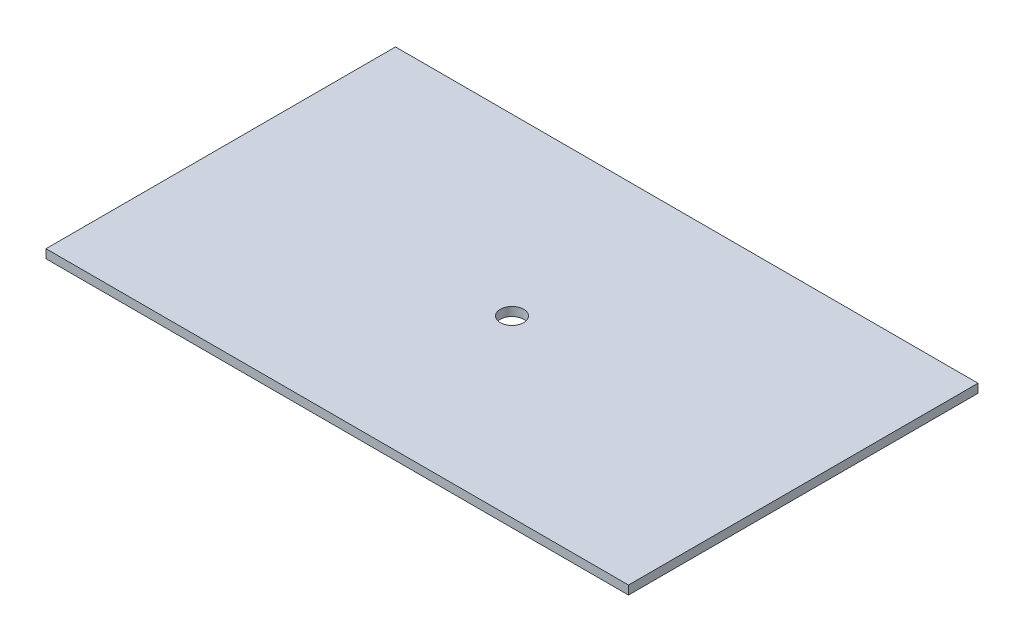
ISO-10303-21;
HEADER;
FILE_DESCRIPTION(('STEP AP214'),'2;1');
FILE_NAME('part.step','',(''),(''),'','','');
FILE_SCHEMA(('AUTOMOTIVE_DESIGN { 1 0 10303 214 1 1 1 1 }'));
ENDSEC;
DATA;
#1=APPLICATION_CONTEXT('core data for automotive mechanical design processes');
#2=APPLICATION_PROTOCOL_DEFINITION('international standard','automotive_design',2000,#1);
#3=PRODUCT_CONTEXT('',#1,'mechanical');
#4=PRODUCT('Part','Part','',(#3));
#5=PRODUCT_RELATED_PRODUCT_CATEGORY('part','',(#4));
#6=PRODUCT_DEFINITION_FORMATION('','',#4);
#7=PRODUCT_DEFINITION_CONTEXT('part definition',#1,'design');
#8=PRODUCT_DEFINITION('design','',#6,#7);
#9=PRODUCT_DEFINITION_SHAPE('','',#8);
#10=(LENGTH_UNIT() NAMED_UNIT(*) SI_UNIT(.MILLI.,.METRE.));
#11=(NAMED_UNIT(*) PLANE_ANGLE_UNIT() SI_UNIT($,.RADIAN.));
#12=(NAMED_UNIT(*) SI_UNIT($,.STERADIAN.) SOLID_ANGLE_UNIT());
#13=UNCERTAINTY_MEASURE_WITH_UNIT(LENGTH_MEASURE(1.E-05),#10,'distance_accuracy_value','');
#14=(GEOMETRIC_REPRESENTATION_CONTEXT(3) GLOBAL_UNCERTAINTY_ASSIGNED_CONTEXT((#13)) GLOBAL_UNIT_ASSIGNED_CONTEXT((#10,
#11,#12)) REPRESENTATION_CONTEXT('',''));
#15=CARTESIAN_POINT('',(0.,0.,0.));
#16=DIRECTION('',(0.,0.,1.));
#17=DIRECTION('',(1.,0.,0.));
#18=AXIS2_PLACEMENT_3D('',#15,#16,#17);
#19=CARTESIAN_POINT('',(-50.,1.5,-30.));
#20=DIRECTION('',(1.,0.,0.));
#21=DIRECTION('',(0.,0.,-1.));
#22=AXIS2_PLACEMENT_3D('',#19,#20,#21);
#23=PLANE('',#22);
#24=DIRECTION('',(0.,0.,1.));
#25=VECTOR('',#24,1.);
#26=CARTESIAN_POINT('',(-50.,0.,-30.));
#27=LINE('',#26,#25);
#28=CARTESIAN_POINT('',(-50.,0.,-30.));
#29=VERTEX_POINT('',#28);
#30=CARTESIAN_POINT('',(-50.,0.,30.));
#31=VERTEX_POINT('',#30);
#32=EDGE_CURVE('E88',#29,#31,#27,.T.);
#33=ORIENTED_EDGE('',*,*,#32,.T.);
#34=DIRECTION('',(0.,-1.,0.));
#35=VECTOR('',#34,1.);
#36=CARTESIAN_POINT('',(-50.,1.5,30.));
#37=LINE('',#36,#35);
#38=CARTESIAN_POINT('',(-50.,1.5,30.));
#39=VERTEX_POINT('',#38);
#40=EDGE_CURVE('E11',#39,#31,#37,.T.);
#41=ORIENTED_EDGE('',*,*,#40,.F.);
#42=DIRECTION('',(0.,0.,1.));
#43=VECTOR('',#42,1.);
#44=CARTESIAN_POINT('',(-50.,1.5,-30.));
#45=LINE('',#44,#43);
#46=CARTESIAN_POINT('',(-50.,1.5,-30.));
#47=VERTEX_POINT('',#46);
#48=EDGE_CURVE('E111',#47,#39,#45,.T.);
#49=ORIENTED_EDGE('',*,*,#48,.F.);
#50=DIRECTION('',(0.,-1.,0.));
#51=VECTOR('',#50,1.);
#52=CARTESIAN_POINT('',(-50.,1.5,-30.));
#53=LINE('',#52,#51);
#54=EDGE_CURVE('E100',#47,#29,#53,.T.);
#55=ORIENTED_EDGE('',*,*,#54,.T.);
#56=EDGE_LOOP('',(#33,#41,#49,#55));
#57=FACE_BOUND('',#56,.T.);
#58=ADVANCED_FACE('F44',(#57),#23,.F.);
#59=CARTESIAN_POINT('',(-50.,1.5,30.));
#60=DIRECTION('',(0.,0.,-1.));
#61=DIRECTION('',(-1.,0.,0.));
#62=AXIS2_PLACEMENT_3D('',#59,#60,#61);
#63=PLANE('',#62);
#64=DIRECTION('',(1.,0.,0.));
#65=VECTOR('',#64,1.);
#66=CARTESIAN_POINT('',(-50.,0.,30.));
#67=LINE('',#66,#65);
#68=CARTESIAN_POINT('',(50.,0.,30.));
#69=VERTEX_POINT('',#68);
#70=EDGE_CURVE('E84',#31,#69,#67,.T.);
#71=ORIENTED_EDGE('',*,*,#70,.T.);
#72=DIRECTION('',(0.,-1.,0.));
#73=VECTOR('',#72,1.);
#74=CARTESIAN_POINT('',(50.,1.5,30.));
#75=LINE('',#74,#73);
#76=CARTESIAN_POINT('',(50.,1.5,30.));
#77=VERTEX_POINT('',#76);
#78=EDGE_CURVE('E51',#77,#69,#75,.T.);
#79=ORIENTED_EDGE('',*,*,#78,.F.);
#80=DIRECTION('',(1.,0.,0.));
#81=VECTOR('',#80,1.);
#82=CARTESIAN_POINT('',(-50.,1.5,30.));
#83=LINE('',#82,#81);
#84=EDGE_CURVE('E96',#39,#77,#83,.T.);
#85=ORIENTED_EDGE('',*,*,#84,.F.);
#86=ORIENTED_EDGE('',*,*,#40,.T.);
#87=EDGE_LOOP('',(#71,#79,#85,#86));
#88=FACE_BOUND('',#87,.T.);
#89=ADVANCED_FACE('F95',(#88),#63,.F.);
#90=CARTESIAN_POINT('',(50.,1.5,-30.));
#91=DIRECTION('',(-1.,0.,0.));
#92=DIRECTION('',(0.,0.,1.));
#93=AXIS2_PLACEMENT_3D('',#90,#91,#92);
#94=PLANE('',#93);
#95=DIRECTION('',(0.,0.,-1.));
#96=VECTOR('',#95,1.);
#97=CARTESIAN_POINT('',(50.,0.,-30.));
#98=LINE('',#97,#96);
#99=CARTESIAN_POINT('',(50.,0.,-30.));
#100=VERTEX_POINT('',#99);
#101=EDGE_CURVE('E89',#69,#100,#98,.T.);
#102=ORIENTED_EDGE('',*,*,#101,.T.);
#103=DIRECTION('',(0.,-1.,0.));
#104=VECTOR('',#103,1.);
#105=CARTESIAN_POINT('',(50.,1.5,-30.));
#106=LINE('',#105,#104);
#107=CARTESIAN_POINT('',(50.,1.5,-30.));
#108=VERTEX_POINT('',#107);
#109=EDGE_CURVE('E117',#108,#100,#106,.T.);
#110=ORIENTED_EDGE('',*,*,#109,.F.);
#111=DIRECTION('',(0.,0.,-1.));
#112=VECTOR('',#111,1.);
#113=CARTESIAN_POINT('',(50.,1.5,-30.));
#114=LINE('',#113,#112);
#115=EDGE_CURVE('E63',#77,#108,#114,.T.);
#116=ORIENTED_EDGE('',*,*,#115,.F.);
#117=ORIENTED_EDGE('',*,*,#78,.T.);
#118=EDGE_LOOP('',(#102,#110,#116,#117));
#119=FACE_BOUND('',#118,.T.);
#120=ADVANCED_FACE('F120',(#119),#94,.F.);
#121=CARTESIAN_POINT('',(-50.,1.5,-30.));
#122=DIRECTION('',(0.,0.,1.));
#123=DIRECTION('',(1.,0.,0.));
#124=AXIS2_PLACEMENT_3D('',#121,#122,#123);
#125=PLANE('',#124);
#126=DIRECTION('',(-1.,0.,0.));
#127=VECTOR('',#126,1.);
#128=CARTESIAN_POINT('',(-50.,0.,-30.));
#129=LINE('',#128,#127);
#130=EDGE_CURVE('E109',#100,#29,#129,.T.);
#131=ORIENTED_EDGE('',*,*,#130,.T.);
#132=ORIENTED_EDGE('',*,*,#54,.F.);
#133=DIRECTION('',(-1.,0.,0.));
#134=VECTOR('',#133,1.);
#135=CARTESIAN_POINT('',(-50.,1.5,-30.));
#136=LINE('',#135,#134);
#137=EDGE_CURVE('E58',#108,#47,#136,.T.);
#138=ORIENTED_EDGE('',*,*,#137,.F.);
#139=ORIENTED_EDGE('',*,*,#109,.T.);
#140=EDGE_LOOP('',(#131,#132,#138,#139));
#141=FACE_BOUND('',#140,.T.);
#142=ADVANCED_FACE('F122',(#141),#125,.F.);
#143=CARTESIAN_POINT('',(-50.,1.5,30.));
#144=DIRECTION('',(0.,1.,0.));
#145=DIRECTION('',(0.,0.,1.));
#146=AXIS2_PLACEMENT_3D('',#143,#144,#145);
#147=PLANE('',#146);
#148=CARTESIAN_POINT('',(0.,1.5,0.));
#149=DIRECTION('',(0.,1.,0.));
#150=DIRECTION('',(0.,0.,1.));
#151=AXIS2_PLACEMENT_3D('',#148,#149,#150);
#152=CIRCLE('',#151,2.);
#153=CARTESIAN_POINT('',(0.,1.5,2.));
#154=VERTEX_POINT('',#153);
#155=EDGE_CURVE('E104',#154,#154,#152,.T.);
#156=ORIENTED_EDGE('',*,*,#155,.F.);
#157=EDGE_LOOP('',(#156));
#158=FACE_BOUND('',#157,.T.);
#159=ORIENTED_EDGE('',*,*,#48,.T.);
#160=ORIENTED_EDGE('',*,*,#84,.T.);
#161=ORIENTED_EDGE('',*,*,#115,.T.);
#162=ORIENTED_EDGE('',*,*,#137,.T.);
#163=EDGE_LOOP('',(#159,#160,#161,#162));
#164=FACE_BOUND('',#163,.T.);
#165=ADVANCED_FACE('F123',(#158,#164),#147,.T.);
#166=CARTESIAN_POINT('',(-50.,0.,30.));
#167=DIRECTION('',(0.,1.,0.));
#168=DIRECTION('',(0.,0.,1.));
#169=AXIS2_PLACEMENT_3D('',#166,#167,#168);
#170=PLANE('',#169);
#171=CARTESIAN_POINT('',(0.,0.,0.));
#172=DIRECTION('',(0.,1.,0.));
#173=DIRECTION('',(0.,0.,1.));
#174=AXIS2_PLACEMENT_3D('',#171,#172,#173);
#175=CIRCLE('',#174,2.);
#176=CARTESIAN_POINT('',(0.,0.,2.));
#177=VERTEX_POINT('',#176);
#178=EDGE_CURVE('E101',#177,#177,#175,.T.);
#179=ORIENTED_EDGE('',*,*,#178,.T.);
#180=EDGE_LOOP('',(#179));
#181=FACE_BOUND('',#180,.T.);
#182=ORIENTED_EDGE('',*,*,#32,.F.);
#183=ORIENTED_EDGE('',*,*,#130,.F.);
#184=ORIENTED_EDGE('',*,*,#101,.F.);
#185=ORIENTED_EDGE('',*,*,#70,.F.);
#186=EDGE_LOOP('',(#182,#183,#184,#185));
#187=FACE_BOUND('',#186,.T.);
#188=ADVANCED_FACE('F85',(#181,#187),#170,.F.);
#189=CARTESIAN_POINT('',(0.,0.,0.));
#190=DIRECTION('',(0.,1.,0.));
#191=DIRECTION('',(0.,0.,1.));
#192=AXIS2_PLACEMENT_3D('',#189,#190,#191);
#193=CYLINDRICAL_SURFACE('',#192,2.);
#194=ORIENTED_EDGE('',*,*,#178,.F.);
#195=EDGE_LOOP('',(#194));
#196=FACE_BOUND('',#195,.T.);
#197=ORIENTED_EDGE('',*,*,#155,.T.);
#198=EDGE_LOOP('',(#197));
#199=FACE_BOUND('',#198,.T.);
#200=ADVANCED_FACE('F131',(#196,#199),#193,.F.);
#201=CLOSED_SHELL('',(#58,#89,#120,#142,#165,#188,#200));
#202=MANIFOLD_SOLID_BREP('B2',#201);
#203=ADVANCED_BREP_SHAPE_REPRESENTATION('',(#18,#202),#14);
#204=SHAPE_DEFINITION_REPRESENTATION(#9,#203);
ENDSEC;
END-ISO-10303-21;
